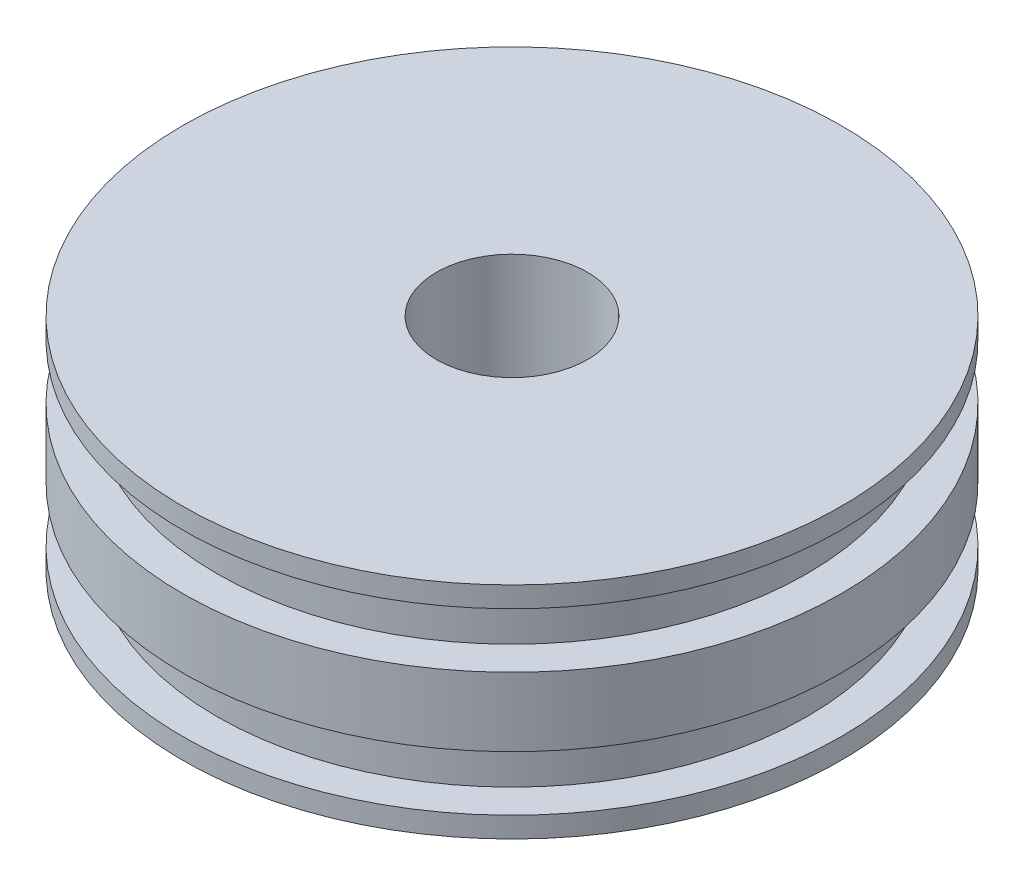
from build123d import *

# Parameters (mm, degrees)
SKETCH1_W               = 38.0365
SKETCH1_H               = 25.4
F_3_4_16_TAPPED_HOLE1_D = 17.4625
SKETCH4_W               = 3.96875
SKETCH4_H               = 6.35
LPATTERN1_COUNT         = 2
LPATTERN1_PITCH         = 14.2875


with BuildPart() as part:
    # Sketch1 → Revolve1 (revolve)
    with BuildSketch(Plane.XY, mode=Mode.PRIVATE) as revolve1_sk:
        with Locations((19.01825, 12.7)):
            Rectangle(SKETCH1_W, SKETCH1_H)
    revolve(revolve1_sk.sketch.rotate(Axis((0, 0, 0), (0, -1, 0)), 180), axis=Axis((0, 0, 0), (0, -1, 0)))

    # 3_4-16 Tapped Hole1 (through all)
    with Locations(Plane(origin=(0, 25.4, 0), x_dir=(-1, 0, 0), z_dir=(0, 1, 0))):
        with Locations((0, 0)):
            Hole(F_3_4_16_TAPPED_HOLE1_D / 2)

    # Sketch4 → Cut-Revolve1 (revolve, cut)
    with BuildSketch(Plane.XY, mode=Mode.PRIVATE) as cut_revolve1_sk:
        with Locations((36.052125, 5.55625)):
            Rectangle(SKETCH4_W, SKETCH4_H)
    cut_revolve1 = revolve(cut_revolve1_sk.sketch.rotate(Axis((0, 0, 0), (0, 1, 0)), 180), axis=Axis((0, 0, 0), (0, 1, 0)), mode=Mode.SUBTRACT)

    # LPattern1: Cut-Revolve1 ×2
    with Locations(*[(0, i * LPATTERN1_PITCH, 0) for i in range(1, LPATTERN1_COUNT)]):
        add(cut_revolve1, mode=Mode.SUBTRACT)


solid = part.part
